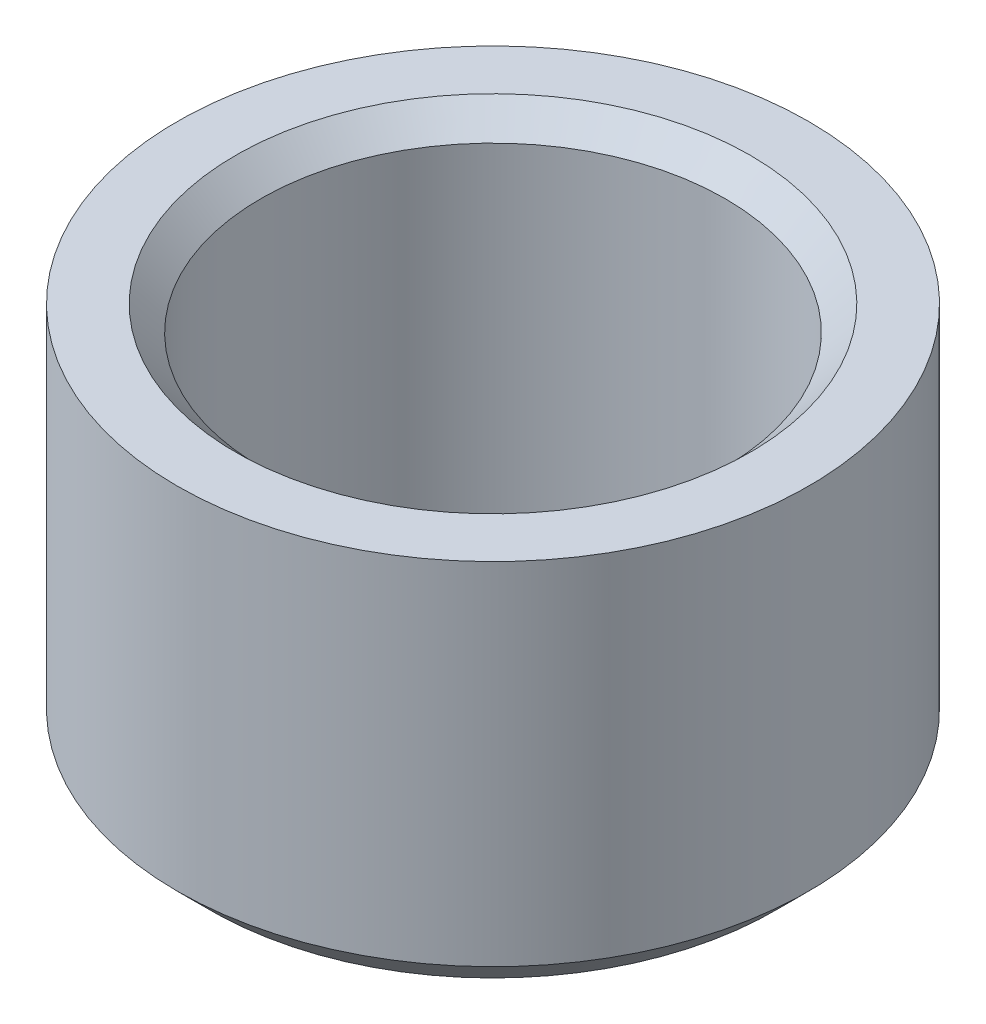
ISO-10303-21;
HEADER;
FILE_DESCRIPTION(('STEP AP214'),'2;1');
FILE_NAME('part.step','',(''),(''),'','','');
FILE_SCHEMA(('AUTOMOTIVE_DESIGN { 1 0 10303 214 1 1 1 1 }'));
ENDSEC;
DATA;
#1=APPLICATION_CONTEXT('core data for automotive mechanical design processes');
#2=APPLICATION_PROTOCOL_DEFINITION('international standard','automotive_design',2000,#1);
#3=PRODUCT_CONTEXT('',#1,'mechanical');
#4=PRODUCT('Part','Part','',(#3));
#5=PRODUCT_RELATED_PRODUCT_CATEGORY('part','',(#4));
#6=PRODUCT_DEFINITION_FORMATION('','',#4);
#7=PRODUCT_DEFINITION_CONTEXT('part definition',#1,'design');
#8=PRODUCT_DEFINITION('design','',#6,#7);
#9=PRODUCT_DEFINITION_SHAPE('','',#8);
#10=(LENGTH_UNIT() NAMED_UNIT(*) SI_UNIT(.MILLI.,.METRE.));
#11=(NAMED_UNIT(*) PLANE_ANGLE_UNIT() SI_UNIT($,.RADIAN.));
#12=(NAMED_UNIT(*) SI_UNIT($,.STERADIAN.) SOLID_ANGLE_UNIT());
#13=UNCERTAINTY_MEASURE_WITH_UNIT(LENGTH_MEASURE(1.E-05),#10,'distance_accuracy_value','');
#14=(GEOMETRIC_REPRESENTATION_CONTEXT(3) GLOBAL_UNCERTAINTY_ASSIGNED_CONTEXT((#13)) GLOBAL_UNIT_ASSIGNED_CONTEXT((#10,
#11,#12)) REPRESENTATION_CONTEXT('',''));
#15=CARTESIAN_POINT('',(0.,0.,0.));
#16=DIRECTION('',(0.,0.,1.));
#17=DIRECTION('',(1.,0.,0.));
#18=AXIS2_PLACEMENT_3D('',#15,#16,#17);
#19=CARTESIAN_POINT('',(0.,0.,0.));
#20=DIRECTION('',(0.,-1.,0.));
#21=DIRECTION('',(0.,0.,-1.));
#22=AXIS2_PLACEMENT_3D('',#19,#20,#21);
#23=CYLINDRICAL_SURFACE('',#22,13.9);
#24=CARTESIAN_POINT('',(0.,0.,0.));
#25=DIRECTION('',(0.,-1.,0.));
#26=DIRECTION('',(0.,0.,-1.));
#27=AXIS2_PLACEMENT_3D('',#24,#25,#26);
#28=CIRCLE('',#27,13.9);
#29=CARTESIAN_POINT('',(0.,0.,-13.9));
#30=VERTEX_POINT('',#29);
#31=EDGE_CURVE('E10',#30,#30,#28,.T.);
#32=ORIENTED_EDGE('',*,*,#31,.T.);
#33=EDGE_LOOP('',(#32));
#34=FACE_BOUND('',#33,.T.);
#35=CARTESIAN_POINT('',(0.,21.5,0.));
#36=DIRECTION('',(0.,-1.,0.));
#37=DIRECTION('',(0.,0.,-1.));
#38=AXIS2_PLACEMENT_3D('',#35,#36,#37);
#39=CIRCLE('',#38,13.9);
#40=CARTESIAN_POINT('',(0.,21.5,-13.9));
#41=VERTEX_POINT('',#40);
#42=EDGE_CURVE('E58',#41,#41,#39,.T.);
#43=ORIENTED_EDGE('',*,*,#42,.F.);
#44=EDGE_LOOP('',(#43));
#45=FACE_BOUND('',#44,.T.);
#46=ADVANCED_FACE('F36',(#34,#45),#23,.F.);
#47=CARTESIAN_POINT('',(13.9,0.,0.));
#48=DIRECTION('',(0.,-1.,0.));
#49=DIRECTION('',(0.,0.,-1.));
#50=AXIS2_PLACEMENT_3D('',#47,#48,#49);
#51=PLANE('',#50);
#52=CARTESIAN_POINT('',(0.,0.,0.));
#53=DIRECTION('',(0.,-1.,0.));
#54=DIRECTION('',(0.,0.,-1.));
#55=AXIS2_PLACEMENT_3D('',#52,#53,#54);
#56=CIRCLE('',#55,16.9);
#57=CARTESIAN_POINT('',(0.,0.,-16.9));
#58=VERTEX_POINT('',#57);
#59=EDGE_CURVE('E42',#58,#58,#56,.T.);
#60=ORIENTED_EDGE('',*,*,#59,.T.);
#61=EDGE_LOOP('',(#60));
#62=FACE_BOUND('',#61,.T.);
#63=ORIENTED_EDGE('',*,*,#31,.F.);
#64=EDGE_LOOP('',(#63));
#65=FACE_BOUND('',#64,.T.);
#66=ADVANCED_FACE('F66',(#62,#65),#51,.T.);
#67=CARTESIAN_POINT('',(0.,0.,0.));
#68=DIRECTION('',(0.,1.,0.));
#69=DIRECTION('',(0.,0.,1.));
#70=AXIS2_PLACEMENT_3D('',#67,#68,#69);
#71=CONICAL_SURFACE('',#70,16.9,0.785398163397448);
#72=CARTESIAN_POINT('',(0.,2.,0.));
#73=DIRECTION('',(0.,-1.,0.));
#74=DIRECTION('',(0.,0.,-1.));
#75=AXIS2_PLACEMENT_3D('',#72,#73,#74);
#76=CIRCLE('',#75,18.9);
#77=CARTESIAN_POINT('',(0.,2.,-18.9));
#78=VERTEX_POINT('',#77);
#79=EDGE_CURVE('E46',#78,#78,#76,.T.);
#80=ORIENTED_EDGE('',*,*,#79,.T.);
#81=EDGE_LOOP('',(#80));
#82=FACE_BOUND('',#81,.T.);
#83=ORIENTED_EDGE('',*,*,#59,.F.);
#84=EDGE_LOOP('',(#83));
#85=FACE_BOUND('',#84,.T.);
#86=ADVANCED_FACE('F70',(#82,#85),#71,.T.);
#87=CARTESIAN_POINT('',(0.,0.,0.));
#88=DIRECTION('',(0.,-1.,0.));
#89=DIRECTION('',(0.,0.,-1.));
#90=AXIS2_PLACEMENT_3D('',#87,#88,#89);
#91=CYLINDRICAL_SURFACE('',#90,18.9);
#92=CARTESIAN_POINT('',(0.,23.,0.));
#93=DIRECTION('',(0.,-1.,0.));
#94=DIRECTION('',(0.,0.,-1.));
#95=AXIS2_PLACEMENT_3D('',#92,#93,#94);
#96=CIRCLE('',#95,18.9);
#97=CARTESIAN_POINT('',(0.,23.,-18.9));
#98=VERTEX_POINT('',#97);
#99=EDGE_CURVE('E50',#98,#98,#96,.T.);
#100=ORIENTED_EDGE('',*,*,#99,.T.);
#101=EDGE_LOOP('',(#100));
#102=FACE_BOUND('',#101,.T.);
#103=ORIENTED_EDGE('',*,*,#79,.F.);
#104=EDGE_LOOP('',(#103));
#105=FACE_BOUND('',#104,.T.);
#106=ADVANCED_FACE('F74',(#102,#105),#91,.T.);
#107=CARTESIAN_POINT('',(18.9,23.,0.));
#108=DIRECTION('',(0.,1.,0.));
#109=DIRECTION('',(0.,0.,1.));
#110=AXIS2_PLACEMENT_3D('',#107,#108,#109);
#111=PLANE('',#110);
#112=CARTESIAN_POINT('',(0.,23.,0.));
#113=DIRECTION('',(0.,-1.,0.));
#114=DIRECTION('',(0.,0.,-1.));
#115=AXIS2_PLACEMENT_3D('',#112,#113,#114);
#116=CIRCLE('',#115,15.4);
#117=CARTESIAN_POINT('',(0.,23.,-15.4));
#118=VERTEX_POINT('',#117);
#119=EDGE_CURVE('E55',#118,#118,#116,.T.);
#120=ORIENTED_EDGE('',*,*,#119,.T.);
#121=EDGE_LOOP('',(#120));
#122=FACE_BOUND('',#121,.T.);
#123=ORIENTED_EDGE('',*,*,#99,.F.);
#124=EDGE_LOOP('',(#123));
#125=FACE_BOUND('',#124,.T.);
#126=ADVANCED_FACE('F81',(#122,#125),#111,.T.);
#127=CARTESIAN_POINT('',(0.,23.,0.));
#128=DIRECTION('',(0.,1.,0.));
#129=DIRECTION('',(0.,0.,1.));
#130=AXIS2_PLACEMENT_3D('',#127,#128,#129);
#131=CONICAL_SURFACE('',#130,15.4,0.785398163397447);
#132=ORIENTED_EDGE('',*,*,#42,.T.);
#133=EDGE_LOOP('',(#132));
#134=FACE_BOUND('',#133,.T.);
#135=ORIENTED_EDGE('',*,*,#119,.F.);
#136=EDGE_LOOP('',(#135));
#137=FACE_BOUND('',#136,.T.);
#138=ADVANCED_FACE('F62',(#134,#137),#131,.F.);
#139=CLOSED_SHELL('',(#46,#66,#86,#106,#126,#138));
#140=MANIFOLD_SOLID_BREP('B2',#139);
#141=ADVANCED_BREP_SHAPE_REPRESENTATION('',(#18,#140),#14);
#142=SHAPE_DEFINITION_REPRESENTATION(#9,#141);
ENDSEC;
END-ISO-10303-21;
